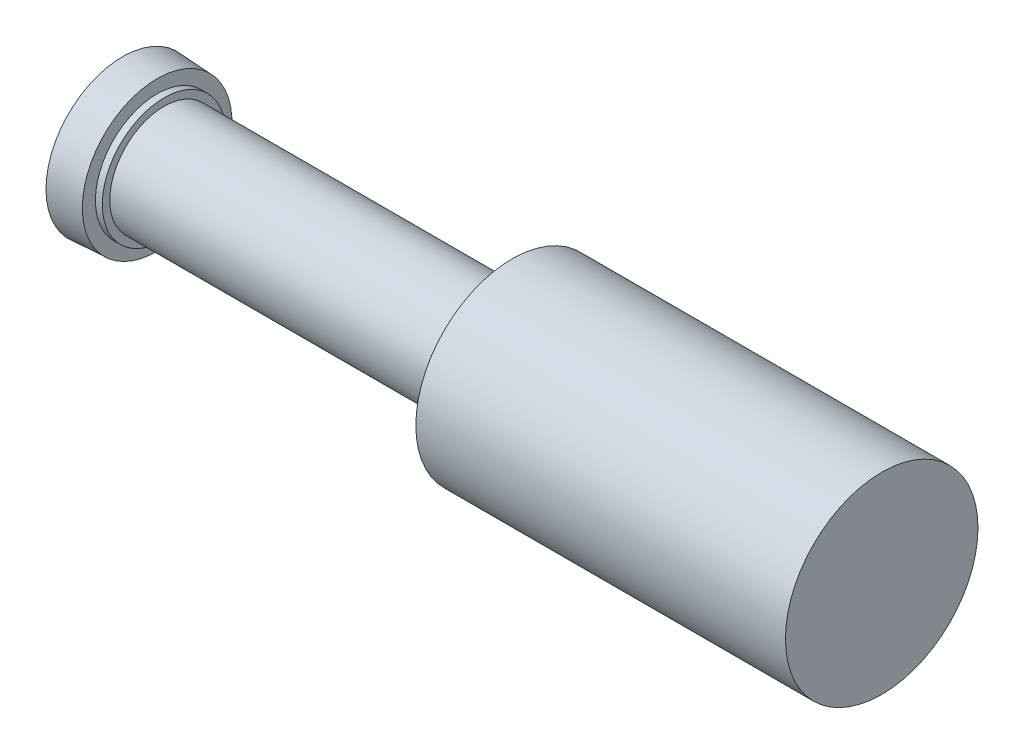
from build123d import *

# Parameters (mm, degrees)
SKETCH1_R           = 6.975
BOSS_EXTRUDE1_DEPTH = 27.5
SKETCH2_R           = 6.975
SKETCH2_R_2         = 5.55
CUT_EXTRUDE1_DEPTH  = 2.5
CUT_EXTRUDE1_DRAFT  = 3
CUT_EXTRUDE2_START  = -0.5
SKETCH6_R           = 6.975
SKETCH6_R_2         = 4.47
CUT_EXTRUDE2_DEPTH  = 0.5
CUT_EXTRUDE3_START  = -25.22
SKETCH7_R           = 6.975
SKETCH7_R_2         = 3.93
CUT_EXTRUDE3_DEPTH  = 25.22


with BuildPart() as part:
    # Sketch1 → Boss-Extrude1 (new, symmetric)
    with BuildSketch(Plane(origin=(0, 0, 0), x_dir=(0, 0, -1), z_dir=(1, 0, 0))):
        Circle(SKETCH1_R)
    extrude(amount=BOSS_EXTRUDE1_DEPTH, both=True)


with BuildPart() as cut_extrude1_tool:
    # Sketch2 → Cut-Extrude1 (with draft: the straight prism first)
    with BuildSketch(Plane.ZY.offset(27.5)):
        Circle(SKETCH2_R)
        Circle(SKETCH2_R_2, mode=Mode.SUBTRACT)
    extrude(amount=-CUT_EXTRUDE1_DEPTH)
    # Cut-Extrude1: the draft: its side faces are tilted about the plane it starts from
    cut_extrude1_sides = [cut_extrude1_tool.faces().sort_by_distance(p)[0] for p in [
        (-26.25, 0, -6.975),
        (-26.25, 0, -5.55),
    ]]
    draft(cut_extrude1_sides, Plane.ZY.offset(27.5), CUT_EXTRUDE1_DRAFT)


with BuildPart() as part_1:
    add(part.part)

    # Cut-Extrude1: cut by cut_extrude1_tool
    add(cut_extrude1_tool.part, mode=Mode.SUBTRACT)

    # Sketch6 → Cut-Extrude2 (cut)
    with BuildSketch(Plane.ZY.offset(25).offset(CUT_EXTRUDE2_START)):
        Circle(SKETCH6_R)
        Circle(SKETCH6_R_2, mode=Mode.SUBTRACT)
    extrude(amount=CUT_EXTRUDE2_DEPTH, mode=Mode.SUBTRACT)

    # Sketch7 → Cut-Extrude3 (cut)
    with BuildSketch(Plane.ZY.offset(24.5).offset(CUT_EXTRUDE3_START)):
        Circle(SKETCH7_R)
        Circle(SKETCH7_R_2, mode=Mode.SUBTRACT)
    extrude(amount=CUT_EXTRUDE3_DEPTH, mode=Mode.SUBTRACT)


solid = part_1.part
